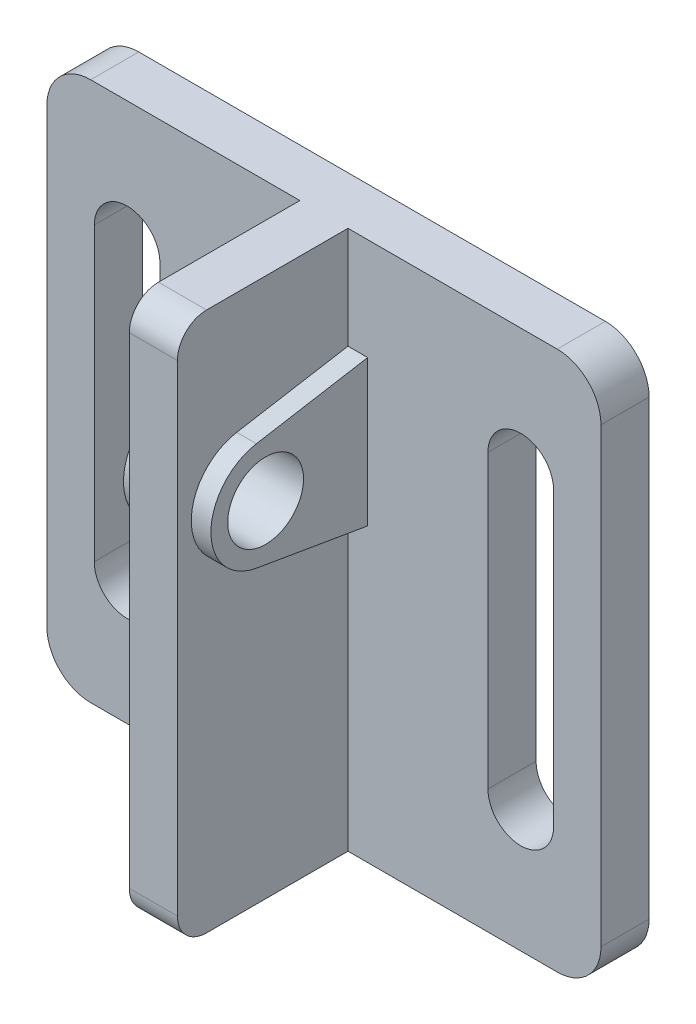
from build123d import *

# Parameters (mm, degrees)
ESQUISSE1_W             = 38
ESQUISSE1_H             = 37
BOSS_EXTRU_1_DEPTH      = 3.3
CONG_1_R                = 3
ENL_V_MAT_EXTRU_1_REACH = 28.723
ESQUISSE3_W             = 3.3
ESQUISSE3_H             = 37
BOSS_EXTRU_2_DEPTH      = 11.7
CONG_2_R                = 2
BOSS_EXTRU_3_DEPTH      = 1.35
ENL_V_MAT_EXTRU_2_REACH = 34.423
ESQUISSE5_R             = 2.6


with BuildPart() as part:
    # Esquisse1 → Boss.-Extru.1 (new body)
    with BuildSketch(Plane.XY):
        Rectangle(ESQUISSE1_W, ESQUISSE1_H)
    extrude(amount=BOSS_EXTRU_1_DEPTH)

    # Cong_1
    cong_1_edges = [part.edges().sort_by_distance(p)[0] for p in [
        (19, -18.5, 1.65),
        (-19, -18.5, 1.65),
        (-19, 18.5, 1.65),
        (19, 18.5, 1.65),
    ]]
    fillet(cong_1_edges, radius=CONG_1_R)

    # Esquisse2 → Enl_v. mat.-Extru.1 (cut, up to next)
    with BuildSketch(Plane.XY.offset(3.3), mode=Mode.PRIVATE) as enl_v_mat_extru_1_sk1:
        with BuildLine():
            Line((-11.25, 10), (-11.25, -10))
            ThreePointArc((-11.25, -10), (-13.5, -12.25), (-15.75, -10))
            Line((-15.75, -10), (-15.75, 10))
            ThreePointArc((-15.75, 10), (-13.5, 12.25), (-11.25, 10))
        make_face()
    enl_v_mat_extru_1_tool1 = extrude(enl_v_mat_extru_1_sk1.sketch, amount=-ENL_V_MAT_EXTRU_1_REACH, mode=Mode.PRIVATE) & part.part
    # Esquisse2 → Enl_v. mat.-Extru.1 (cut, up to next)
    with BuildSketch(Plane.XY.offset(3.3), mode=Mode.PRIVATE) as enl_v_mat_extru_1_sk2:
        with BuildLine():
            Line((11.25, 10), (11.25, -10))
            ThreePointArc((11.25, -10), (13.5, -12.25), (15.75, -10))
            Line((15.75, -10), (15.75, 10))
            ThreePointArc((15.75, 10), (13.5, 12.25), (11.25, 10))
        make_face()
    enl_v_mat_extru_1_tool2 = extrude(enl_v_mat_extru_1_sk2.sketch, amount=-ENL_V_MAT_EXTRU_1_REACH, mode=Mode.PRIVATE) & part.part
    add(enl_v_mat_extru_1_tool1.solids().sort_by_distance((-13.5, 0, 3.3))[0], mode=Mode.SUBTRACT)
    add(enl_v_mat_extru_1_tool2.solids().sort_by_distance((13.5, 0, 3.3))[0], mode=Mode.SUBTRACT)

    # Esquisse3 → Boss.-Extru.2 (add)
    with BuildSketch(Plane.XY.offset(3.3)):
        Rectangle(ESQUISSE3_W, ESQUISSE3_H)
    extrude(amount=BOSS_EXTRU_2_DEPTH)

    # Cong_2
    cong_2_edges = [part.edges().sort_by_distance(p)[0] for p in [
        (0, 18.5, 15),
        (0, -18.5, 15),
    ]]
    fillet(cong_2_edges, radius=CONG_2_R)

    # Esquisse4 → Boss.-Extru.3 (add)
    with BuildSketch(Plane(origin=(1.65, 0, 0), x_dir=(0, 0, -1), z_dir=(1, 0, 0))):
        with BuildLine():
            Line((-3.3, 11.5), (-10.931401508, 10.196462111))
            ThreePointArc((-10.931401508, 10.196462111), (-14.05, 6.5), (-10.931401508, 2.803537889))
            Line((-10.931401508, 2.803537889), (-3.3, 1.5))
            Line((-3.3, 1.5), (-3.3, 11.5))
        make_face()
    boss_extru_3 = extrude(amount=BOSS_EXTRU_3_DEPTH)

    # Sym_trie1: Boss.-Extru.3 across plane
    add(boss_extru_3.mirror(Plane(origin=(0, 0, 0), x_dir=(0, 0, 1), z_dir=(1, 0, 0))))

    # Esquisse5 → Enl_v. mat.-Extru.2 (cut, up to next)
    with BuildSketch(Plane(origin=(3, 0, 0), x_dir=(0, 0, -1), z_dir=(1, 0, 0)), mode=Mode.PRIVATE) as enl_v_mat_extru_2_sk1:
        with Locations((-10.3, 6.5)):
            Circle(ESQUISSE5_R)
    enl_v_mat_extru_2_tool1 = extrude(enl_v_mat_extru_2_sk1.sketch, amount=-ENL_V_MAT_EXTRU_2_REACH, mode=Mode.PRIVATE) & part.part
    add(enl_v_mat_extru_2_tool1.solids().sort_by_distance((3, 6.5, 10.3))[0], mode=Mode.SUBTRACT)


solid = part.part
